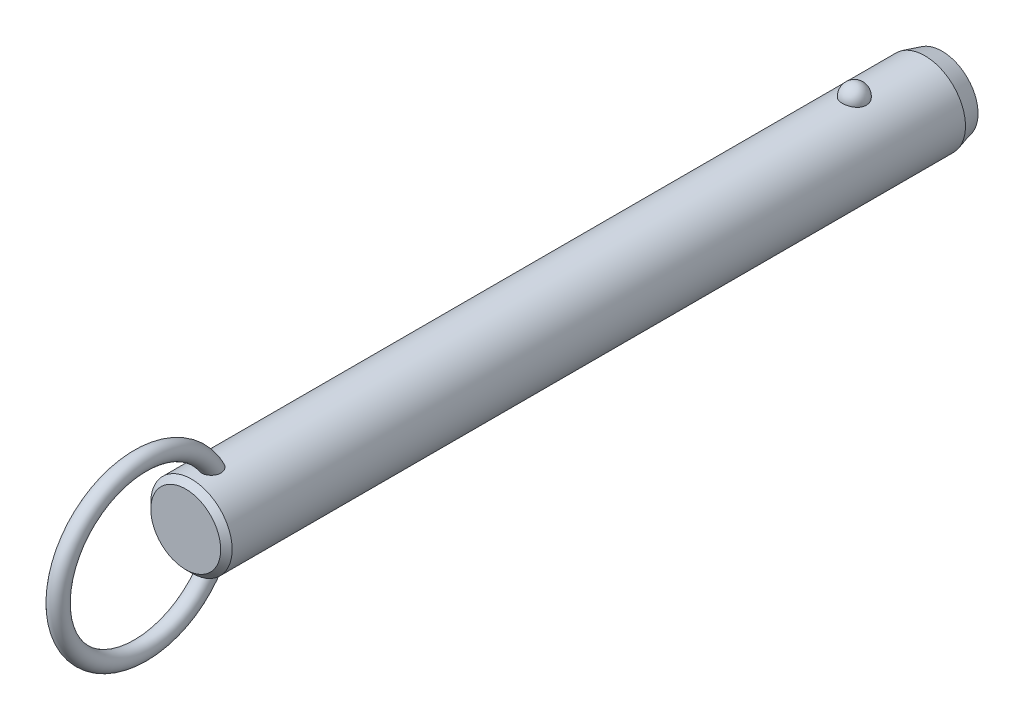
ISO-10303-21;
HEADER;
FILE_DESCRIPTION(('STEP AP214'),'2;1');
FILE_NAME('part.step','',(''),(''),'','','');
FILE_SCHEMA(('AUTOMOTIVE_DESIGN { 1 0 10303 214 1 1 1 1 }'));
ENDSEC;
DATA;
#1=APPLICATION_CONTEXT('core data for automotive mechanical design processes');
#2=APPLICATION_PROTOCOL_DEFINITION('international standard','automotive_design',2000,#1);
#3=PRODUCT_CONTEXT('',#1,'mechanical');
#4=PRODUCT('Part','Part','',(#3));
#5=PRODUCT_RELATED_PRODUCT_CATEGORY('part','',(#4));
#6=PRODUCT_DEFINITION_FORMATION('','',#4);
#7=PRODUCT_DEFINITION_CONTEXT('part definition',#1,'design');
#8=PRODUCT_DEFINITION('design','',#6,#7);
#9=PRODUCT_DEFINITION_SHAPE('','',#8);
#10=(LENGTH_UNIT() NAMED_UNIT(*) SI_UNIT(.MILLI.,.METRE.));
#11=(NAMED_UNIT(*) PLANE_ANGLE_UNIT() SI_UNIT($,.RADIAN.));
#12=(NAMED_UNIT(*) SI_UNIT($,.STERADIAN.) SOLID_ANGLE_UNIT());
#13=UNCERTAINTY_MEASURE_WITH_UNIT(LENGTH_MEASURE(1.E-05),#10,'distance_accuracy_value','');
#14=(GEOMETRIC_REPRESENTATION_CONTEXT(3) GLOBAL_UNCERTAINTY_ASSIGNED_CONTEXT((#13)) GLOBAL_UNIT_ASSIGNED_CONTEXT((#10,
#11,#12)) REPRESENTATION_CONTEXT('',''));
#15=CARTESIAN_POINT('',(0.,0.,0.));
#16=DIRECTION('',(0.,0.,1.));
#17=DIRECTION('',(1.,0.,0.));
#18=AXIS2_PLACEMENT_3D('',#15,#16,#17);
#19=CARTESIAN_POINT('',(0.,0.,106.7));
#20=DIRECTION('',(0.,0.,-1.));
#21=DIRECTION('',(-1.,0.,0.));
#22=AXIS2_PLACEMENT_3D('',#19,#20,#21);
#23=CYLINDRICAL_SURFACE('',#22,7.1);
#24=CARTESIAN_POINT('',(2.0769088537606,6.78943661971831,-2.1));
#25=CARTESIAN_POINT('',(2.07690739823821,6.78943796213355,-1.98268154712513));
#26=CARTESIAN_POINT('',(2.06738130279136,6.79237331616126,-1.86534506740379));
#27=CARTESIAN_POINT('',(2.0295040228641,6.8037853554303,-1.63400788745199));
#28=CARTESIAN_POINT('',(2.00114757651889,6.81226358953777,-1.52000812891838));
#29=CARTESIAN_POINT('',(1.92632025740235,6.83379798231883,-1.29863433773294));
#30=CARTESIAN_POINT('',(1.87985726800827,6.84685214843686,-1.19125744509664));
#31=CARTESIAN_POINT('',(1.76995205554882,6.87608091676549,-0.986046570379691));
#32=CARTESIAN_POINT('',(1.70650980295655,6.8922555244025,-0.888212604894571));
#33=CARTESIAN_POINT('',(1.56381192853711,6.92602930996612,-0.704242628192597));
#34=CARTESIAN_POINT('',(1.4844714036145,6.94363582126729,-0.618173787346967));
#35=CARTESIAN_POINT('',(1.31221746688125,6.97823658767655,-0.460740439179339));
#36=CARTESIAN_POINT('',(1.21930409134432,6.99523084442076,-0.389375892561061));
#37=CARTESIAN_POINT('',(1.02268781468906,7.02666176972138,-0.263547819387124));
#38=CARTESIAN_POINT('',(0.919020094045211,7.04110638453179,-0.209031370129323));
#39=CARTESIAN_POINT('',(0.703548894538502,7.06588726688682,-0.118163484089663));
#40=CARTESIAN_POINT('',(0.591746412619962,7.07622403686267,-0.0818098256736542));
#41=CARTESIAN_POINT('',(0.365557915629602,7.09147068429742,-0.028871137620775));
#42=CARTESIAN_POINT('',(0.251267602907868,7.09648447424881,-0.0119070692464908));
#43=CARTESIAN_POINT('',(0.0213499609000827,7.10089837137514,0.00304925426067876));
#44=CARTESIAN_POINT('',(-0.0942772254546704,7.10029907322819,0.00104351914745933));
#45=CARTESIAN_POINT('',(-0.321651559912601,7.09360829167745,-0.0216931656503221));
#46=CARTESIAN_POINT('',(-0.433431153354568,7.08760388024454,-0.0421272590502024));
#47=CARTESIAN_POINT('',(-0.651862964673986,7.07086131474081,-0.100729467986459));
#48=CARTESIAN_POINT('',(-0.758515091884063,7.06012307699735,-0.138897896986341));
#49=CARTESIAN_POINT('',(-0.964449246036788,7.03496097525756,-0.232213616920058));
#50=CARTESIAN_POINT('',(-1.06368095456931,7.02051445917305,-0.287465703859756));
#51=CARTESIAN_POINT('',(-1.25145353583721,6.98948740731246,-0.413383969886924));
#52=CARTESIAN_POINT('',(-1.33999321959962,6.97290663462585,-0.484051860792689));
#53=CARTESIAN_POINT('',(-1.50591604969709,6.93898770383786,-0.640594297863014));
#54=CARTESIAN_POINT('',(-1.58302488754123,6.92164094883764,-0.726757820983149));
#55=CARTESIAN_POINT('',(-1.72189320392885,6.8884103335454,-0.910927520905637));
#56=CARTESIAN_POINT('',(-1.78365144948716,6.87252659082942,-1.008934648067));
#57=CARTESIAN_POINT('',(-1.89101272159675,6.84377189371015,-1.21549497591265));
#58=CARTESIAN_POINT('',(-1.93639553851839,6.83094274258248,-1.32416860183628));
#59=CARTESIAN_POINT('',(-2.00874275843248,6.81002070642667,-1.54791500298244));
#60=CARTESIAN_POINT('',(-2.03570774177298,6.80192767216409,-1.66298757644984));
#61=CARTESIAN_POINT('',(-2.07047276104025,6.7914266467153,-1.89571453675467));
#62=CARTESIAN_POINT('',(-2.07835878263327,6.78899315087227,-2.01335491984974));
#63=CARTESIAN_POINT('',(-2.07502083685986,6.79001409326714,-2.24833570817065));
#64=CARTESIAN_POINT('',(-2.06379746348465,6.7934683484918,-2.36567612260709));
#65=CARTESIAN_POINT('',(-2.02263913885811,6.80583442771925,-2.59603194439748));
#66=CARTESIAN_POINT('',(-1.99281127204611,6.81471501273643,-2.70906820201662));
#67=CARTESIAN_POINT('',(-1.91526639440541,6.83691232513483,-2.92836575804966));
#68=CARTESIAN_POINT('',(-1.8675486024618,6.85022924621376,-3.03462676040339));
#69=CARTESIAN_POINT('',(-1.75504492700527,6.87991336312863,-3.23806487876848));
#70=CARTESIAN_POINT('',(-1.69015924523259,6.89629822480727,-3.33518422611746));
#71=CARTESIAN_POINT('',(-1.54505404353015,6.93024852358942,-3.51697105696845));
#72=CARTESIAN_POINT('',(-1.46483385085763,6.94781401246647,-3.60163799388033));
#73=CARTESIAN_POINT('',(-1.29071406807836,6.98225977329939,-3.75654119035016));
#74=CARTESIAN_POINT('',(-1.19675650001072,6.99913673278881,-3.82671308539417));
#75=CARTESIAN_POINT('',(-0.997940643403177,7.03023618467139,-3.9501837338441));
#76=CARTESIAN_POINT('',(-0.893083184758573,7.04445887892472,-4.00348377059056));
#77=CARTESIAN_POINT('',(-0.676902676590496,7.06848365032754,-4.09107242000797));
#78=CARTESIAN_POINT('',(-0.565686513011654,7.0783430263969,-4.12560889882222));
#79=CARTESIAN_POINT('',(-0.338739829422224,7.09282534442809,-4.17575450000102));
#80=CARTESIAN_POINT('',(-0.223009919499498,7.09744899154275,-4.19136617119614));
#81=CARTESIAN_POINT('',(0.00707628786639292,7.10090930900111,-4.20307965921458));
#82=CARTESIAN_POINT('',(0.121410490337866,7.09986531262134,-4.19958377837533));
#83=CARTESIAN_POINT('',(0.34781544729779,7.092380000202,-4.17411564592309));
#84=CARTESIAN_POINT('',(0.459886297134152,7.08593891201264,-4.15214417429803));
#85=CARTESIAN_POINT('',(0.678084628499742,7.06838983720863,-4.09049562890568));
#86=CARTESIAN_POINT('',(0.784237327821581,7.05730369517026,-4.05090137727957));
#87=CARTESIAN_POINT('',(0.988305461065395,7.03163139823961,-3.95511447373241));
#88=CARTESIAN_POINT('',(1.08622031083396,7.01704499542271,-3.89892064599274));
#89=CARTESIAN_POINT('',(1.27284490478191,6.98562668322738,-3.77035541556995));
#90=CARTESIAN_POINT('',(1.36137372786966,6.96876135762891,-3.69772964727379));
#91=CARTESIAN_POINT('',(1.52509486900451,6.93477412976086,-3.53878279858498));
#92=CARTESIAN_POINT('',(1.60028496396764,6.91765218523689,-3.45245943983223));
#93=CARTESIAN_POINT('',(1.73681688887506,6.88465753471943,-3.26658774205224));
#94=CARTESIAN_POINT('',(1.79785966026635,6.86881574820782,-3.16681408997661));
#95=CARTESIAN_POINT('',(1.90265327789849,6.84053157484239,-2.95814408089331));
#96=CARTESIAN_POINT('',(1.94640861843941,6.82808830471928,-2.84925010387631));
#97=CARTESIAN_POINT('',(2.01274378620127,6.80881460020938,-2.63454318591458));
#98=CARTESIAN_POINT('',(2.03676193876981,6.80160856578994,-2.52920574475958));
#99=CARTESIAN_POINT('',(2.06884490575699,6.79191902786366,-2.3159172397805));
#100=CARTESIAN_POINT('',(2.07691019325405,6.78943538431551,-2.20796625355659));
#101=CARTESIAN_POINT('',(2.0769088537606,6.78943661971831,-2.1));
#102=B_SPLINE_CURVE_WITH_KNOTS('',3,(#24,#25,#26,#27,#28,#29,#30,#31,#32,#33,#34,#35,#36,#37,
#38,#39,#40,#41,#42,#43,#44,#45,#46,#47,#48,#49,#50,#51,#52,#53,#54,#55,#56,#57,#58,#59,#60,#61,
#62,#63,#64,#65,#66,#67,#68,#69,#70,#71,#72,#73,#74,#75,#76,#77,#78,#79,#80,#81,#82,#83,#84,#85,
#86,#87,#88,#89,#90,#91,#92,#93,#94,#95,#96,#97,#98,#99,#100,#101),.UNSPECIFIED.,.T.,.F.,(4,2,2,
2,2,2,2,2,2,2,2,2,2,2,2,2,2,2,2,2,2,2,2,2,2,2,2,2,2,2,2,2,2,2,2,2,2,2,4),(0.,0.351568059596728,
0.703234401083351,1.05474780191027,1.40626181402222,1.75970563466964,2.11314851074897,
2.4654696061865,2.81774759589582,3.16301449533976,3.50824481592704,3.84801136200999,
4.18778391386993,4.52968352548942,4.87162112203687,5.22076181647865,5.56993054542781,
5.92363364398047,6.27732559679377,6.62942052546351,6.98150450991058,7.33158042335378,
7.68167162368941,8.03384443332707,8.38603269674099,8.73975272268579,9.09344583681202,
9.44234545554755,9.79119807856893,10.1327344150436,10.4742563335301,10.8141898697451,
11.1541474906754,11.4997793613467,11.8454687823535,12.1979079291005,12.5502553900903,
12.8738073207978,13.1973496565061),.UNSPECIFIED.);
#103=CARTESIAN_POINT('',(2.0769088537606,6.78943661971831,-2.1));
#104=VERTEX_POINT('',#103);
#105=EDGE_CURVE('E41',#104,#104,#102,.T.);
#106=ORIENTED_EDGE('',*,*,#105,.T.);
#107=EDGE_LOOP('',(#106));
#108=FACE_BOUND('',#107,.T.);
#109=CARTESIAN_POINT('',(0.,0.,113.62));
#110=DIRECTION('',(0.,0.,1.));
#111=DIRECTION('',(1.,0.,0.));
#112=AXIS2_PLACEMENT_3D('',#109,#110,#111);
#113=CIRCLE('',#112,7.1);
#114=CARTESIAN_POINT('',(7.1,0.,113.62));
#115=VERTEX_POINT('',#114);
#116=EDGE_CURVE('E10',#115,#115,#113,.F.);
#117=ORIENTED_EDGE('',*,*,#116,.T.);
#118=EDGE_LOOP('',(#117));
#119=FACE_BOUND('',#118,.T.);
#120=CARTESIAN_POINT('',(-0.429539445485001,-7.08699541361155,108.442921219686));
#121=CARTESIAN_POINT('',(-0.508331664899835,-7.08221999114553,108.466876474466));
#122=CARTESIAN_POINT('',(-0.585039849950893,-7.07624016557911,108.497457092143));
#123=CARTESIAN_POINT('',(-0.732082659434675,-7.06254296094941,108.571024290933));
#124=CARTESIAN_POINT('',(-0.802417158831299,-7.05482554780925,108.614011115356));
#125=CARTESIAN_POINT('',(-0.934722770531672,-7.03851844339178,108.711113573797));
#126=CARTESIAN_POINT('',(-0.996700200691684,-7.02992941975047,108.765220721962));
#127=CARTESIAN_POINT('',(-1.11079942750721,-7.01280697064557,108.882967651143));
#128=CARTESIAN_POINT('',(-1.16292136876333,-7.00427354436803,108.946607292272));
#129=CARTESIAN_POINT('',(-1.25705660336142,-6.98799959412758,109.082687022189));
#130=CARTESIAN_POINT('',(-1.29888032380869,-6.98027525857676,109.155259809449));
#131=CARTESIAN_POINT('',(-1.37069920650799,-6.96652886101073,109.306168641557));
#132=CARTESIAN_POINT('',(-1.40069157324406,-6.96050720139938,109.384506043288));
#133=CARTESIAN_POINT('',(-1.45043507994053,-6.95031881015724,109.550190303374));
#134=CARTESIAN_POINT('',(-1.46937115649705,-6.94630231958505,109.637789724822));
#135=CARTESIAN_POINT('',(-1.49424917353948,-6.94099239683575,109.814871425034));
#136=CARTESIAN_POINT('',(-1.50018601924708,-6.93970003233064,109.904354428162));
#137=CARTESIAN_POINT('',(-1.49978214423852,-6.93978815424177,110.094060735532));
#138=CARTESIAN_POINT('',(-1.49187639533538,-6.94150934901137,110.194279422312));
#139=CARTESIAN_POINT('',(-1.46177925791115,-6.94790814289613,110.392479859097));
#140=CARTESIAN_POINT('',(-1.43957541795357,-6.95258831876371,110.490459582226));
#141=CARTESIAN_POINT('',(-1.37783293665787,-6.96510647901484,110.69536292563));
#142=CARTESIAN_POINT('',(-1.33634073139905,-6.97328848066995,110.801680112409));
#143=CARTESIAN_POINT('',(-1.23686994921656,-6.99161706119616,111.006177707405));
#144=CARTESIAN_POINT('',(-1.17889192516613,-7.00176357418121,111.104358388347));
#145=CARTESIAN_POINT('',(-1.0587512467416,-7.02082898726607,111.272374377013));
#146=CARTESIAN_POINT('',(-0.999247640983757,-7.02963746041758,111.344123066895));
#147=CARTESIAN_POINT('',(-0.869494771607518,-7.04686074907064,111.477195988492));
#148=CARTESIAN_POINT('',(-0.79926347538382,-7.05527619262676,111.538537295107));
#149=CARTESIAN_POINT('',(-0.665408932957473,-7.06899457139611,111.635131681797));
#150=CARTESIAN_POINT('',(-0.603817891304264,-7.07457275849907,111.673151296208));
#151=CARTESIAN_POINT('',(-0.475172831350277,-7.08437420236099,111.738758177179));
#152=CARTESIAN_POINT('',(-0.408123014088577,-7.08859848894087,111.766353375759));
#153=CARTESIAN_POINT('',(-0.269431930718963,-7.09522749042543,111.809256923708));
#154=CARTESIAN_POINT('',(-0.197757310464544,-7.09761688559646,111.824461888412));
#155=CARTESIAN_POINT('',(-0.0527849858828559,-7.10017268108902,111.840716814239));
#156=CARTESIAN_POINT('',(0.0205115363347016,-7.10034065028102,111.841776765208));
#157=CARTESIAN_POINT('',(0.15642613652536,-7.09855986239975,111.830461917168));
#158=CARTESIAN_POINT('',(0.219199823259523,-7.09688191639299,111.819806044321));
#159=CARTESIAN_POINT('',(0.342134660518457,-7.09201880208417,111.788537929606));
#160=CARTESIAN_POINT('',(0.402295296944,-7.08883333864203,111.767923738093));
#161=CARTESIAN_POINT('',(0.520687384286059,-7.08113868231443,111.717212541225));
#162=CARTESIAN_POINT('',(0.578791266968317,-7.07658958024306,111.686827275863));
#163=CARTESIAN_POINT('',(0.690173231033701,-7.06659708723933,111.618367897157));
#164=CARTESIAN_POINT('',(0.743447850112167,-7.061153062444,111.580288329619));
#165=CARTESIAN_POINT('',(0.870947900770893,-7.04680292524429,111.476592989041));
#166=CARTESIAN_POINT('',(0.941828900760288,-7.0375580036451,111.406897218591));
#167=CARTESIAN_POINT('',(1.07136606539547,-7.01900793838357,111.256945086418));
#168=CARTESIAN_POINT('',(1.13000013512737,-7.00970271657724,111.176670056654));
#169=CARTESIAN_POINT('',(1.23579584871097,-6.99183327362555,111.006899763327));
#170=CARTESIAN_POINT('',(1.28274271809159,-6.98328455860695,110.917269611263));
#171=CARTESIAN_POINT('',(1.36351442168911,-6.96796352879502,110.732176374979));
#172=CARTESIAN_POINT('',(1.39733971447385,-6.96119115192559,110.636713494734));
#173=CARTESIAN_POINT('',(1.45579181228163,-6.94922464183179,110.42530928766));
#174=CARTESIAN_POINT('',(1.47790145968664,-6.94449000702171,110.308631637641));
#175=CARTESIAN_POINT('',(1.50168752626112,-6.93938731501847,110.073015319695));
#176=CARTESIAN_POINT('',(1.50336085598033,-6.93901991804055,109.95407631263));
#177=CARTESIAN_POINT('',(1.48486516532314,-6.9430010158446,109.72360799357));
#178=CARTESIAN_POINT('',(1.46573441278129,-6.9471253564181,109.611995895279));
#179=CARTESIAN_POINT('',(1.40606892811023,-6.95944667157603,109.394886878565));
#180=CARTESIAN_POINT('',(1.3655644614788,-6.96763788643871,109.2893815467));
#181=CARTESIAN_POINT('',(1.27082700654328,-6.98548038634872,109.104287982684));
#182=CARTESIAN_POINT('',(1.21949810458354,-6.99473841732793,109.023171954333));
#183=CARTESIAN_POINT('',(1.10242050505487,-7.01414069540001,108.872227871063));
#184=CARTESIAN_POINT('',(1.03668119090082,-7.02428436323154,108.80239252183));
#185=CARTESIAN_POINT('',(0.900559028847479,-7.04295285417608,108.683573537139));
#186=CARTESIAN_POINT('',(0.831428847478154,-7.05153466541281,108.633157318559));
#187=CARTESIAN_POINT('',(0.685291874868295,-7.06723150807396,108.545142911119));
#188=CARTESIAN_POINT('',(0.608287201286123,-7.0743469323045,108.507541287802));
#189=CARTESIAN_POINT('',(0.451878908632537,-7.08602232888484,108.447491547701));
#190=CARTESIAN_POINT('',(0.372686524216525,-7.09067127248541,108.424508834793));
#191=CARTESIAN_POINT('',(0.211477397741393,-7.09730788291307,108.392035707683));
#192=CARTESIAN_POINT('',(0.12946098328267,-7.09929585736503,108.38254373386));
#193=CARTESIAN_POINT('',(-0.0332905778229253,-7.10037858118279,108.377351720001));
#194=CARTESIAN_POINT('',(-0.114016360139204,-7.09953334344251,108.381365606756));
#195=CARTESIAN_POINT('',(-0.273670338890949,-7.09517338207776,108.402454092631));
#196=CARTESIAN_POINT('',(-0.352598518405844,-7.09165863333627,108.419528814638));
#197=CARTESIAN_POINT('',(-0.429539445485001,-7.08699541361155,108.442921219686));
#198=B_SPLINE_CURVE_WITH_KNOTS('',3,(#120,#121,#122,#123,#124,#125,#126,#127,#128,#129,#130,
#131,#132,#133,#134,#135,#136,#137,#138,#139,#140,#141,#142,#143,#144,#145,#146,#147,#148,#149,
#150,#151,#152,#153,#154,#155,#156,#157,#158,#159,#160,#161,#162,#163,#164,#165,#166,#167,#168,
#169,#170,#171,#172,#173,#174,#175,#176,#177,#178,#179,#180,#181,#182,#183,#184,#185,#186,#187,
#188,#189,#190,#191,#192,#193,#194,#195,#196,#197),.UNSPECIFIED.,.T.,.F.,(4,2,2,2,2,2,2,2,2,2,2,
2,2,2,2,2,2,2,2,2,2,2,2,2,2,2,2,2,2,2,2,2,2,2,2,2,2,2,4),(0.,0.247183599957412,0.49437204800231,
0.741372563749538,0.988369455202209,1.23962059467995,1.49093106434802,1.75897818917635,
2.02713035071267,2.32758265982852,2.62829697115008,2.97008736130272,3.31186629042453,
3.59175319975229,3.87117637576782,4.08813841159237,4.30493502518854,4.52352259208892,
4.74195577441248,4.93215328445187,5.12238804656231,5.31884850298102,5.515448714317,
5.81332317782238,6.11173048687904,6.41527266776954,6.71880423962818,7.07358156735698,
7.42841252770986,7.76631485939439,8.10373999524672,8.39142246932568,8.67891817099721,
8.93560332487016,9.19221962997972,9.43881106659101,9.68537399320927,9.92674752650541,
10.1681233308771),.UNSPECIFIED.);
#199=CARTESIAN_POINT('',(-0.429539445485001,-7.08699541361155,108.442921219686));
#200=VERTEX_POINT('',#199);
#201=EDGE_CURVE('E60',#200,#200,#198,.T.);
#202=ORIENTED_EDGE('',*,*,#201,.T.);
#203=EDGE_LOOP('',(#202));
#204=FACE_BOUND('',#203,.T.);
#205=CARTESIAN_POINT('',(-0.429539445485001,7.08699541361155,108.442921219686));
#206=CARTESIAN_POINT('',(-0.351665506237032,7.09171429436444,108.419246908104));
#207=CARTESIAN_POINT('',(-0.271733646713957,7.09525896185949,108.402036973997));
#208=CARTESIAN_POINT('',(-0.110026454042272,7.09960839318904,108.381005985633));
#209=CARTESIAN_POINT('',(-0.0282502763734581,7.10041187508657,108.377191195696));
#210=CARTESIAN_POINT('',(0.134782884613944,7.09918849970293,108.383059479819));
#211=CARTESIAN_POINT('',(0.216039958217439,7.09716214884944,108.39274013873));
#212=CARTESIAN_POINT('',(0.375730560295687,7.09050177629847,108.425347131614));
#213=CARTESIAN_POINT('',(0.454164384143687,7.08586802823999,108.448272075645));
#214=CARTESIAN_POINT('',(0.60602533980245,7.07449911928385,108.506771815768));
#215=CARTESIAN_POINT('',(0.679451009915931,7.06776334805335,108.542350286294));
#216=CARTESIAN_POINT('',(0.819234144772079,7.05292866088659,108.625175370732));
#217=CARTESIAN_POINT('',(0.88559181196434,7.04482978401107,108.672421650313));
#218=CARTESIAN_POINT('',(1.00993211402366,7.02808709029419,108.777590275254));
#219=CARTESIAN_POINT('',(1.06785399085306,7.01943990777,108.835583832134));
#220=CARTESIAN_POINT('',(1.17342527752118,7.00256662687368,108.960301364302));
#221=CARTESIAN_POINT('',(1.22107408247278,6.99434055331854,109.027025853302));
#222=CARTESIAN_POINT('',(1.30652927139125,6.97889183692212,109.169362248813));
#223=CARTESIAN_POINT('',(1.34399711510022,6.97170674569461,109.245180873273));
#224=CARTESIAN_POINT('',(1.40682616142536,6.95930080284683,109.401810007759));
#225=CARTESIAN_POINT('',(1.43218374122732,6.95408053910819,109.48262200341));
#226=CARTESIAN_POINT('',(1.47246409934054,6.94566853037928,109.653531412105));
#227=CARTESIAN_POINT('',(1.48642590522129,6.9426653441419,109.74386307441));
#228=CARTESIAN_POINT('',(1.5011410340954,6.93949744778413,109.925619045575));
#229=CARTESIAN_POINT('',(1.50188917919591,6.93933385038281,110.017043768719));
#230=CARTESIAN_POINT('',(1.49030464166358,6.94183245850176,110.21084381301));
#231=CARTESIAN_POINT('',(1.47627413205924,6.94486147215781,110.313112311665));
#232=CARTESIAN_POINT('',(1.43356351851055,6.95380194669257,110.514471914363));
#233=CARTESIAN_POINT('',(1.4048676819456,6.95971650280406,110.613559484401));
#234=CARTESIAN_POINT('',(1.32908750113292,6.97461208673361,110.818908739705));
#235=CARTESIAN_POINT('',(1.28011435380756,6.98388945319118,110.924456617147));
#236=CARTESIAN_POINT('',(1.16520357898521,7.00397743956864,111.125760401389));
#237=CARTESIAN_POINT('',(1.09927694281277,7.01478706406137,111.221522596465));
#238=CARTESIAN_POINT('',(0.969361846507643,7.03373936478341,111.376756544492));
#239=CARTESIAN_POINT('',(0.909042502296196,7.04187023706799,111.439303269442));
#240=CARTESIAN_POINT('',(0.779178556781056,7.05741732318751,111.554053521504));
#241=CARTESIAN_POINT('',(0.709649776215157,7.06483472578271,111.606274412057));
#242=CARTESIAN_POINT('',(0.576854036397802,7.0767751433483,111.688113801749));
#243=CARTESIAN_POINT('',(0.515118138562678,7.08158033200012,111.720164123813));
#244=CARTESIAN_POINT('',(0.387127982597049,7.08972701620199,111.773765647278));
#245=CARTESIAN_POINT('',(0.320877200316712,7.09306962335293,111.795324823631));
#246=CARTESIAN_POINT('',(0.185041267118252,7.09791507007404,111.826400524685));
#247=CARTESIAN_POINT('',(0.115437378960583,7.09940591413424,111.835838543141));
#248=CARTESIAN_POINT('',(-0.0243157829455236,7.10030171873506,111.841522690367));
#249=CARTESIAN_POINT('',(-0.0944648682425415,7.0997073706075,111.837773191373));
#250=CARTESIAN_POINT('',(-0.225713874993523,7.09668414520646,111.818508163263));
#251=CARTESIAN_POINT('',(-0.287006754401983,7.09444865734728,111.804232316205));
#252=CARTESIAN_POINT('',(-0.40655537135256,7.08860360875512,111.766368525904));
#253=CARTESIAN_POINT('',(-0.464809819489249,7.08499346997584,111.742776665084));
#254=CARTESIAN_POINT('',(-0.594955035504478,7.07541654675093,111.678923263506));
#255=CARTESIAN_POINT('',(-0.665389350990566,7.06906574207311,111.635753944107));
#256=CARTESIAN_POINT('',(-0.798242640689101,7.05530261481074,111.538587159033));
#257=CARTESIAN_POINT('',(-0.860645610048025,7.0478882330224,111.484568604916));
#258=CARTESIAN_POINT('',(-0.994249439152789,7.03045217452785,111.350996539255));
#259=CARTESIAN_POINT('',(-1.06260129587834,7.02030745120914,111.268614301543));
#260=CARTESIAN_POINT('',(-1.18502045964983,7.00068382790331,111.093843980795));
#261=CARTESIAN_POINT('',(-1.23907684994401,6.99120544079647,111.001448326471));
#262=CARTESIAN_POINT('',(-1.33335589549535,6.97384343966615,110.808008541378));
#263=CARTESIAN_POINT('',(-1.3733613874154,6.96598557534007,110.706856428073));
#264=CARTESIAN_POINT('',(-1.43770677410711,6.9529905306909,110.499504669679));
#265=CARTESIAN_POINT('',(-1.46204473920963,6.94785368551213,110.39330440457));
#266=CARTESIAN_POINT('',(-1.49537533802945,6.94076296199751,110.168231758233));
#267=CARTESIAN_POINT('',(-1.50273564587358,6.93914842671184,110.04909751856));
#268=CARTESIAN_POINT('',(-1.4954555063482,6.94072368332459,109.811470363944));
#269=CARTESIAN_POINT('',(-1.48082914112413,6.94391040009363,109.692977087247));
#270=CARTESIAN_POINT('',(-1.43076401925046,6.95438579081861,109.473432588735));
#271=CARTESIAN_POINT('',(-1.39762227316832,6.96121852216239,109.371841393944));
#272=CARTESIAN_POINT('',(-1.31211274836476,6.97783941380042,109.177351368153));
#273=CARTESIAN_POINT('',(-1.2597660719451,6.98762432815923,109.08444313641));
#274=CARTESIAN_POINT('',(-1.14583073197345,7.00713153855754,108.924160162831));
#275=CARTESIAN_POINT('',(-1.08665947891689,7.01665982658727,108.855035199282));
#276=CARTESIAN_POINT('',(-0.956606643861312,7.03556646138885,108.728878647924));
#277=CARTESIAN_POINT('',(-0.885737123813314,7.04494495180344,108.671834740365));
#278=CARTESIAN_POINT('',(-0.751558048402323,7.06035735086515,108.583100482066));
#279=CARTESIAN_POINT('',(-0.690120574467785,7.0666695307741,108.548593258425));
#280=CARTESIAN_POINT('',(-0.562815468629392,7.07794609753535,108.488750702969));
#281=CARTESIAN_POINT('',(-0.496948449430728,7.08291067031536,108.463414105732));
#282=CARTESIAN_POINT('',(-0.429539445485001,7.08699541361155,108.442921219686));
#283=B_SPLINE_CURVE_WITH_KNOTS('',3,(#205,#206,#207,#208,#209,#210,#211,#212,#213,#214,#215,
#216,#217,#218,#219,#220,#221,#222,#223,#224,#225,#226,#227,#228,#229,#230,#231,#232,#233,#234,
#235,#236,#237,#238,#239,#240,#241,#242,#243,#244,#245,#246,#247,#248,#249,#250,#251,#252,#253,
#254,#255,#256,#257,#258,#259,#260,#261,#262,#263,#264,#265,#266,#267,#268,#269,#270,#271,#272,
#273,#274,#275,#276,#277,#278,#279,#280,#281,#282),.UNSPECIFIED.,.T.,.F.,(4,2,2,2,2,2,2,2,2,2,2,
2,2,2,2,2,2,2,2,2,2,2,2,2,2,2,2,2,2,2,2,2,2,2,2,2,2,2,4),(0.,0.244335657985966,
0.488785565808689,0.733191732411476,0.977572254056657,1.22202379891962,1.46646834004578,
1.71259457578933,1.95873529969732,2.21226768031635,2.46587585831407,2.73913816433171,
3.01250754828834,3.32109936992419,3.63002293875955,3.9786351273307,4.32702187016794,
4.58793945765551,4.84841449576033,5.05676704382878,5.26496096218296,5.47449661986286,
5.68396281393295,5.87205447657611,6.06022532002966,6.30743751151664,6.55513496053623,
6.87602468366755,7.19715875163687,7.52305774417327,7.84899686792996,8.20516155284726,
8.56109821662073,8.88040084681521,9.19935367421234,9.47236282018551,9.74509220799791,
9.95662250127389,10.1681235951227),.UNSPECIFIED.);
#284=CARTESIAN_POINT('',(-0.429539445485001,7.08699541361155,108.442921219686));
#285=VERTEX_POINT('',#284);
#286=EDGE_CURVE('E67',#285,#285,#283,.T.);
#287=ORIENTED_EDGE('',*,*,#286,.T.);
#288=EDGE_LOOP('',(#287));
#289=FACE_BOUND('',#288,.T.);
#290=CARTESIAN_POINT('',(0.,0.,-14.4000000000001));
#291=DIRECTION('',(0.,0.,-1.));
#292=DIRECTION('',(-1.,0.,0.));
#293=AXIS2_PLACEMENT_3D('',#290,#291,#292);
#294=CIRCLE('',#293,7.1);
#295=CARTESIAN_POINT('',(-7.1,0.,-14.4000000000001));
#296=VERTEX_POINT('',#295);
#297=EDGE_CURVE('E57',#296,#296,#294,.F.);
#298=ORIENTED_EDGE('',*,*,#297,.T.);
#299=EDGE_LOOP('',(#298));
#300=FACE_BOUND('',#299,.T.);
#301=ADVANCED_FACE('F37',(#108,#119,#204,#289,#300),#23,.T.);
#302=CARTESIAN_POINT('',(0.,0.,-17.4));
#303=DIRECTION('',(0.,0.,-1.));
#304=DIRECTION('',(-1.,0.,0.));
#305=AXIS2_PLACEMENT_3D('',#302,#303,#304);
#306=PLANE('',#305);
#307=CARTESIAN_POINT('',(0.,0.,-17.4));
#308=DIRECTION('',(0.,0.,-1.));
#309=DIRECTION('',(-1.,0.,0.));
#310=AXIS2_PLACEMENT_3D('',#307,#308,#309);
#311=CIRCLE('',#310,6.29615242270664);
#312=CARTESIAN_POINT('',(-6.29615242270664,0.,-17.4));
#313=VERTEX_POINT('',#312);
#314=EDGE_CURVE('E66',#313,#313,#311,.T.);
#315=ORIENTED_EDGE('',*,*,#314,.T.);
#316=EDGE_LOOP('',(#315));
#317=FACE_BOUND('',#316,.T.);
#318=ADVANCED_FACE('F85',(#317),#306,.T.);
#319=CARTESIAN_POINT('',(0.,0.,-17.4));
#320=DIRECTION('',(0.,0.,1.));
#321=DIRECTION('',(1.,0.,0.));
#322=AXIS2_PLACEMENT_3D('',#319,#320,#321);
#323=CONICAL_SURFACE('',#322,6.29615242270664,0.261799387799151);
#324=ORIENTED_EDGE('',*,*,#297,.F.);
#325=EDGE_LOOP('',(#324));
#326=FACE_BOUND('',#325,.T.);
#327=ORIENTED_EDGE('',*,*,#314,.F.);
#328=EDGE_LOOP('',(#327));
#329=FACE_BOUND('',#328,.T.);
#330=ADVANCED_FACE('F83',(#326,#329),#323,.T.);
#331=CARTESIAN_POINT('',(0.,0.,114.62));
#332=DIRECTION('',(0.,0.,1.));
#333=DIRECTION('',(1.,0.,0.));
#334=AXIS2_PLACEMENT_3D('',#331,#332,#333);
#335=PLANE('',#334);
#336=CARTESIAN_POINT('',(0.,0.,114.62));
#337=DIRECTION('',(0.,0.,1.));
#338=DIRECTION('',(1.,0.,0.));
#339=AXIS2_PLACEMENT_3D('',#336,#337,#338);
#340=CIRCLE('',#339,6.10000000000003);
#341=CARTESIAN_POINT('',(6.10000000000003,0.,114.62));
#342=VERTEX_POINT('',#341);
#343=EDGE_CURVE('E50',#342,#342,#340,.T.);
#344=ORIENTED_EDGE('',*,*,#343,.T.);
#345=EDGE_LOOP('',(#344));
#346=FACE_BOUND('',#345,.T.);
#347=ADVANCED_FACE('F77',(#346),#335,.T.);
#348=CARTESIAN_POINT('',(0.,0.,122.55));
#349=DIRECTION('',(1.,0.,0.));
#350=DIRECTION('',(0.,0.,-1.));
#351=AXIS2_PLACEMENT_3D('',#348,#349,#350);
#352=TOROIDAL_SURFACE('',#351,14.35,1.5);
#353=ORIENTED_EDGE('',*,*,#286,.F.);
#354=EDGE_LOOP('',(#353));
#355=FACE_BOUND('',#354,.T.);
#356=ORIENTED_EDGE('',*,*,#201,.F.);
#357=EDGE_LOOP('',(#356));
#358=FACE_BOUND('',#357,.T.);
#359=ADVANCED_FACE('F73',(#355,#358),#352,.T.);
#360=CARTESIAN_POINT('',(0.,0.,114.62));
#361=DIRECTION('',(0.,0.,-1.));
#362=DIRECTION('',(-1.,0.,0.));
#363=AXIS2_PLACEMENT_3D('',#360,#361,#362);
#364=CONICAL_SURFACE('',#363,6.10000000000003,0.785398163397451);
#365=ORIENTED_EDGE('',*,*,#116,.F.);
#366=EDGE_LOOP('',(#365));
#367=FACE_BOUND('',#366,.T.);
#368=ORIENTED_EDGE('',*,*,#343,.F.);
#369=EDGE_LOOP('',(#368));
#370=FACE_BOUND('',#369,.T.);
#371=ADVANCED_FACE('F39',(#367,#370),#364,.T.);
#372=CARTESIAN_POINT('',(0.,7.1,-2.1));
#373=DIRECTION('',(0.,1.,0.));
#374=DIRECTION('',(0.,0.,1.));
#375=AXIS2_PLACEMENT_3D('',#372,#373,#374);
#376=SPHERICAL_SURFACE('',#375,2.10000000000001);
#377=ORIENTED_EDGE('',*,*,#105,.F.);
#378=EDGE_LOOP('',(#377));
#379=FACE_BOUND('',#378,.T.);
#380=ADVANCED_FACE('F79',(#379),#376,.T.);
#381=CLOSED_SHELL('',(#301,#318,#330,#347,#359,#371,#380));
#382=MANIFOLD_SOLID_BREP('B2',#381);
#383=ADVANCED_BREP_SHAPE_REPRESENTATION('',(#18,#382),#14);
#384=SHAPE_DEFINITION_REPRESENTATION(#9,#383);
ENDSEC;
END-ISO-10303-21;
